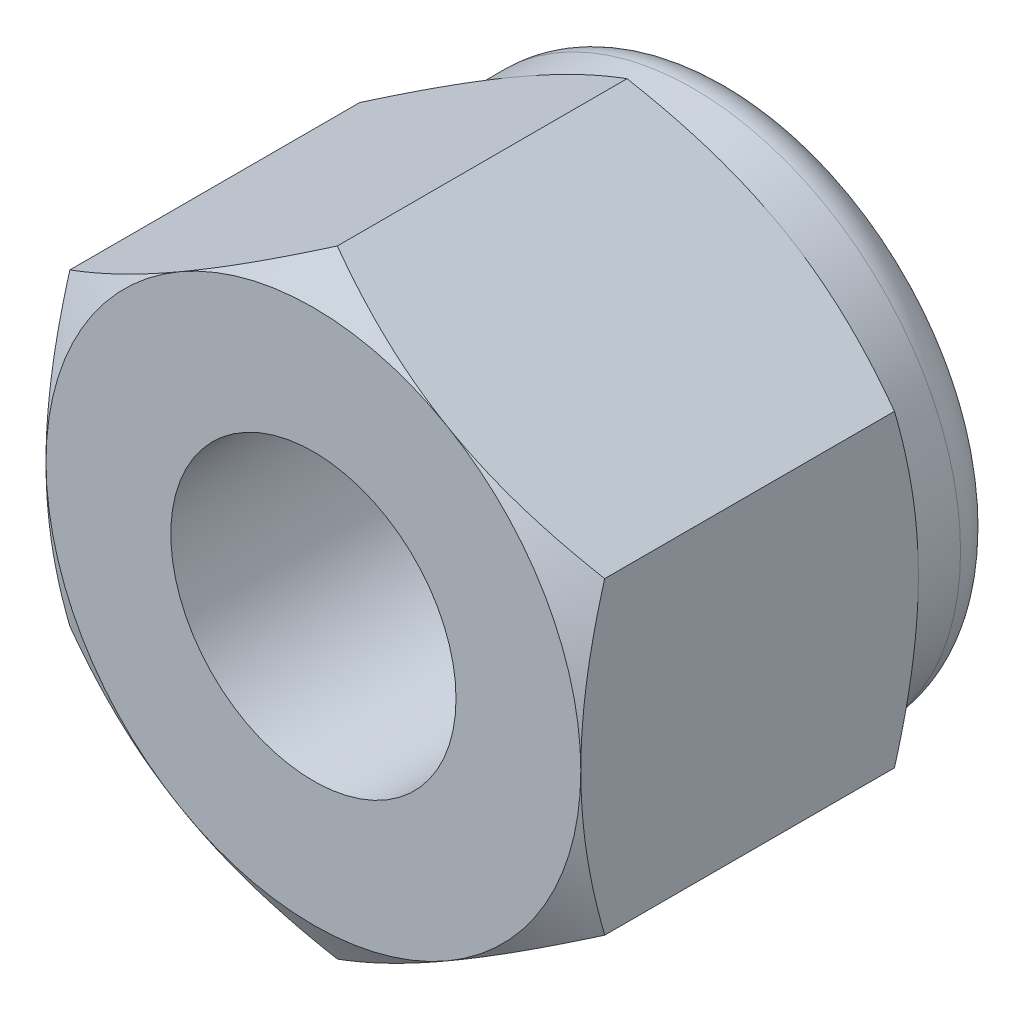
from build123d import *

# Parameters (mm, degrees)
BASE_EXTRUSION_DEPTH    = 11.36
ESQUISSE3_R             = 6
ENL_V_MAT_EXTRU_1_DEPTH = 18.833945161
ESQUISSE5_R             = 6
ESQUISSE5_R_2           = 4.8
BOSS_EXTRU_1_DEPTH      = 11.36


with BuildPart() as part:
    # Esquisse1 → Base-Extrusion (new body)
    with BuildSketch(Plane.XY):
        Polygon((9, -5.196152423), (9, 5.196152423), (0, 10.392304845), (-9, 5.196152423), (-9, -5.196152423), (0, -10.392304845), align=None)
    extrude(amount=-BASE_EXTRUSION_DEPTH)

    # Esquisse2 → Enl_vement de mati_re-R_volution1 (revolve, cut)
    with BuildSketch(Plane(origin=(0, 0, 0), x_dir=(1, 0, 0), z_dir=(0, 1, 0))):
        Polygon((-9, 0), (-19.838048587, 0), (-19.838048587, 11.36), (-9, 11.36), (-18.838048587, 5.68), align=None)
    revolve(axis=Axis((0, 0, -11.36), (0, 0, 1)), mode=Mode.SUBTRACT)

    # Esquisse3 → Enl_v. mat.-Extru.1 (cut, through all)
    with BuildSketch(Plane.XY):
        Circle(ESQUISSE3_R)
    extrude(amount=-ENL_V_MAT_EXTRU_1_DEPTH, mode=Mode.SUBTRACT)

    # Esquisse4 → Boss.-R_vol.1 (revolve)
    with BuildSketch(Plane(origin=(0, 0, 0), x_dir=(0, 0, -1), z_dir=(1, 0, 0)), mode=Mode.PRIVATE) as boss_r_vol_1_sk:
        with BuildLine():
            Line((11.36, 9), (12.78, 9))
            ThreePointArc((12.78, 9), (13.784091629, 8.584091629), (14.2, 7.58))
            Line((14.2, 7.58), (14.2, 7.098076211))
            Line((14.2, 7.098076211), (13.016666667, 7.098076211))
            Line((13.016666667, 7.098076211), (13.016666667, 5.196152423))
            Line((13.016666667, 5.196152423), (11.36, 5.196152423))
            Line((11.36, 5.196152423), (11.36, 9))
        make_face()
    revolve(boss_r_vol_1_sk.sketch.rotate(Axis((0, 0, 0), (0, 0, -1)), 90), axis=Axis((0, 0, 0), (0, 0, -1)))

    # Esquisse5 → Boss.-Extru.1 (add)
    with BuildSketch(Plane.XY):
        Circle(ESQUISSE5_R)
        Circle(ESQUISSE5_R_2, mode=Mode.SUBTRACT)
    extrude(amount=-BOSS_EXTRU_1_DEPTH)


solid = part.part
